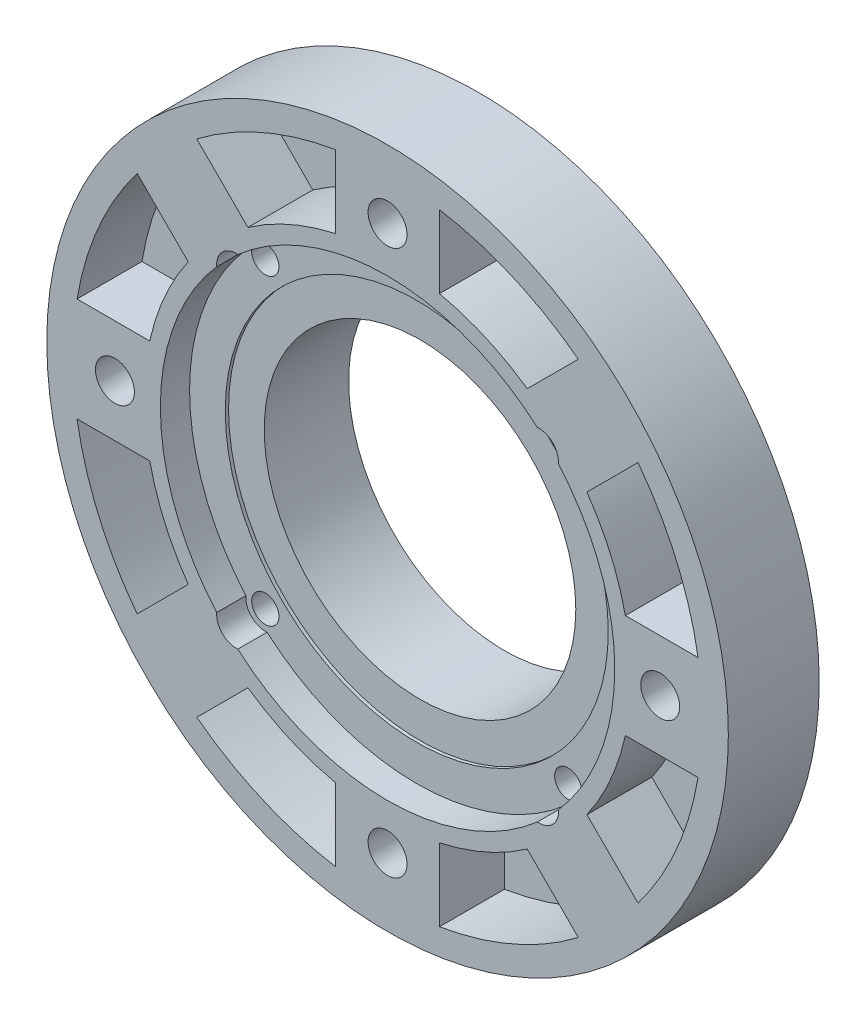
from build123d import *

# Parameters (mm, degrees)
ESQUISSE1_R             = 52.5
ESQUISSE1_R_2           = 24
BASE_EXTRUSION_DEPTH    = 18
ESQUISSE2_R             = 35
ENL_V_MAT_EXTRU_1_DEPTH = 4.5
ESQUISSE3_R             = 29.5
ENL_V_MAT_EXTRU_2_DEPTH = 0.5
ESQUISSE4_R             = 52.5
ESQUISSE4_R_2           = 26
ENL_V_MAT_EXTRU_3_DEPTH = 2
ESQUISSE5_R             = 3
ENL_V_MAT_EXTRU_4_DEPTH = 76.950641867
ESQUISSE6_R             = 52.5
ENL_V_MAT_EXTRU_5_DEPTH = 2
ESQUISSE7_R             = 5.5
ENL_V_MAT_EXTRU_6_DEPTH = 6
ENL_V_MAT_EXTRU_7_DEPTH = 10
ESQUISSE9_R             = 2.1
ENL_V_MAT_EXTRU_8_DEPTH = 76.950641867
ESQUISSE10_R            = 3
ENL_V_MAT_EXTRU_9_DEPTH = 4.5


with BuildPart() as part:
    # Esquisse1 → Base-Extrusion (new body)
    with BuildSketch(Plane.XY):
        with Locations(Location((0, 0, 0), (0, 0, 180))):
            Circle(ESQUISSE1_R)
        Circle(ESQUISSE1_R_2, mode=Mode.SUBTRACT)
    extrude(amount=BASE_EXTRUSION_DEPTH)

    # Esquisse2 → Enl_v. mat.-Extru.1 (cut)
    with BuildSketch(Plane.XY.offset(18)):
        Circle(ESQUISSE2_R)
    extrude(amount=-ENL_V_MAT_EXTRU_1_DEPTH, mode=Mode.SUBTRACT)

    # Esquisse3 → Enl_v. mat.-Extru.2 (cut)
    with BuildSketch(Plane.XY.offset(13.5)):
        Circle(ESQUISSE3_R)
    extrude(amount=-ENL_V_MAT_EXTRU_2_DEPTH, mode=Mode.SUBTRACT)

    # Esquisse4 → Enl_v. mat.-Extru.3 (cut)
    with BuildSketch(Plane(origin=(0, 0, 0), x_dir=(-1, 0, 0), z_dir=(0, 0, -1))):
        Circle(ESQUISSE4_R)
        Circle(ESQUISSE4_R_2, mode=Mode.SUBTRACT)
    extrude(amount=-ENL_V_MAT_EXTRU_3_DEPTH, mode=Mode.SUBTRACT)

    # Esquisse5 → Enl_v. mat.-Extru.4 (cut, through all)
    with BuildSketch(Plane(origin=(0, 0, 2), x_dir=(-1, 0, 0), z_dir=(0, 0, -1))):
        with Locations((42, 0)):
            Circle(ESQUISSE5_R)
        with Locations((0, -42)):
            Circle(ESQUISSE5_R)
        with Locations((-42, 0)):
            Circle(ESQUISSE5_R)
        with Locations((0, 42)):
            Circle(ESQUISSE5_R)
    extrude(amount=-ENL_V_MAT_EXTRU_4_DEPTH, mode=Mode.SUBTRACT)

    # Esquisse6 → Enl_v. mat.-Extru.5 (cut)
    with BuildSketch(Plane(origin=(0, 0, 2), x_dir=(-1, 0, 0), z_dir=(0, 0, -1))):
        Circle(ESQUISSE6_R)
        with BuildLine():
            ThreePointArc((38.468468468, 10.962524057), (28.284271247, 28.284271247), (10.962524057, 38.468468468))
            ThreePointArc((10.962524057, 38.468468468), (9.070885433, 38.386238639), (7.605251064, 37.1875))
            ThreePointArc((7.605251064, 37.1875), (0, 33), (-7.605251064, 37.1875))
            ThreePointArc((-7.605251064, 37.1875), (-9.070885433, 38.386238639), (-10.962524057, 38.468468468))
            ThreePointArc((-10.962524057, 38.468468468), (-28.284271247, 28.284271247), (-38.468468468, 10.962524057))
            ThreePointArc((-38.468468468, 10.962524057), (-38.386238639, 9.070885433), (-37.1875, 7.605251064))
            ThreePointArc((-37.1875, 7.605251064), (-33, 0), (-37.1875, -7.605251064))
            ThreePointArc((-37.1875, -7.605251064), (-38.386238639, -9.070885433), (-38.468468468, -10.962524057))
            ThreePointArc((-38.468468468, -10.962524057), (-28.284271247, -28.284271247), (-10.962524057, -38.468468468))
            ThreePointArc((-10.962524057, -38.468468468), (-9.070885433, -38.386238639), (-7.605251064, -37.1875))
            ThreePointArc((-7.605251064, -37.1875), (0, -33), (7.605251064, -37.1875))
            ThreePointArc((7.605251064, -37.1875), (9.070885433, -38.386238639), (10.962524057, -38.468468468))
            ThreePointArc((10.962524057, -38.468468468), (28.284271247, -28.284271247), (38.468468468, -10.962524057))
            ThreePointArc((38.468468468, -10.962524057), (38.386238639, -9.070885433), (37.1875, -7.605251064))
            ThreePointArc((37.1875, -7.605251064), (33, 0), (37.1875, 7.605251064))
            ThreePointArc((37.1875, 7.605251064), (38.386238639, 9.070885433), (38.468468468, 10.962524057))
        make_face(mode=Mode.SUBTRACT)
    extrude(amount=-ENL_V_MAT_EXTRU_5_DEPTH, mode=Mode.SUBTRACT)

    # Esquisse7 → Enl_v. mat.-Extru.6 (cut)
    with BuildSketch(Plane(origin=(0, 0, 4), x_dir=(-1, 0, 0), z_dir=(0, 0, -1))):
        with Locations((0, 42)):
            Circle(ESQUISSE7_R)
        with Locations((42, 0)):
            Circle(ESQUISSE7_R)
        with Locations((0, -42)):
            Circle(ESQUISSE7_R)
        with Locations((-42, 0)):
            Circle(ESQUISSE7_R)
    extrude(amount=-ENL_V_MAT_EXTRU_6_DEPTH, mode=Mode.SUBTRACT)

    # Esquisse8 → Enl_v. mat.-Extru.7 (cut)
    with BuildSketch(Plane.XY.offset(18)):
        with BuildLine():
            Line((-8, -36.636730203), (-8, -47.835656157))
            ThreePointArc((-8, -47.835656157), (-19.258661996, -44.512402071), (-29.389096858, -38.581485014))
            Line((-29.389096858, -38.581485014), (-21.518935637, -30.711323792))
            ThreePointArc((-21.518935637, -30.711323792), (-15.05388656, -34.345749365), (-8, -36.636730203))
        make_face()
        with BuildLine():
            Line((-8, 47.835656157), (-8, 36.636730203))
            ThreePointArc((-8, 36.636730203), (-15.05388656, 34.345749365), (-21.518935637, 30.711323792))
            Line((-21.518935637, 30.711323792), (-29.389096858, 38.581485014))
            ThreePointArc((-29.389096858, 38.581485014), (-19.258661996, 44.512402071), (-8, 47.835656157))
        make_face()
        with BuildLine():
            Line((8, 47.835656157), (8, 36.636730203))
            ThreePointArc((8, 36.636730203), (15.05388656, 34.345749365), (21.518935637, 30.711323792))
            Line((21.518935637, 30.711323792), (29.389096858, 38.581485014))
            ThreePointArc((29.389096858, 38.581485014), (19.258661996, 44.512402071), (8, 47.835656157))
        make_face()
        with BuildLine():
            Line((8, -36.636730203), (8, -47.835656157))
            ThreePointArc((8, -47.835656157), (19.258661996, -44.512402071), (29.389096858, -38.581485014))
            Line((29.389096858, -38.581485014), (21.518935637, -30.711323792))
            ThreePointArc((21.518935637, -30.711323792), (15.05388656, -34.345749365), (8, -36.636730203))
        make_face()
        with BuildLine():
            Line((-47.835656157, 8), (-36.636730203, 8))
            ThreePointArc((-36.636730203, 8), (-34.345749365, 15.05388656), (-30.711323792, 21.518935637))
            Line((-30.711323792, 21.518935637), (-38.581485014, 29.389096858))
            ThreePointArc((-38.581485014, 29.389096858), (-44.512402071, 19.258661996), (-47.835656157, 8))
        make_face()
        with BuildLine():
            Line((-47.835656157, -8), (-36.636730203, -8))
            ThreePointArc((-36.636730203, -8), (-34.345749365, -15.05388656), (-30.711323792, -21.518935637))
            Line((-30.711323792, -21.518935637), (-38.581485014, -29.389096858))
            ThreePointArc((-38.581485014, -29.389096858), (-44.512402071, -19.258661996), (-47.835656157, -8))
        make_face()
        with BuildLine():
            Line((36.636730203, -8), (47.835656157, -8))
            ThreePointArc((47.835656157, -8), (44.512402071, -19.258661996), (38.581485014, -29.389096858))
            Line((38.581485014, -29.389096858), (30.711323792, -21.518935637))
            ThreePointArc((30.711323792, -21.518935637), (34.345749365, -15.05388656), (36.636730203, -8))
        make_face()
        with BuildLine():
            Line((36.636730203, 8), (47.835656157, 8))
            ThreePointArc((47.835656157, 8), (44.512402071, 19.258661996), (38.581485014, 29.389096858))
            Line((38.581485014, 29.389096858), (30.711323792, 21.518935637))
            ThreePointArc((30.711323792, 21.518935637), (34.345749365, 15.05388656), (36.636730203, 8))
        make_face()
    extrude(amount=-ENL_V_MAT_EXTRU_7_DEPTH, mode=Mode.SUBTRACT)

    # Esquisse9 → Enl_v. mat.-Extru.8 (cut, through all)
    with BuildSketch(Plane(origin=(0, 0, 2), x_dir=(-1, 0, 0), z_dir=(0, 0, -1))):
        with Locations((23.334523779, 23.334523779)):
            Circle(ESQUISSE9_R)
        with Locations((23.334523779, -23.334523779)):
            Circle(ESQUISSE9_R)
        with Locations((-23.334523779, -23.334523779)):
            Circle(ESQUISSE9_R)
        with Locations((-23.334523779, 23.334523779)):
            Circle(ESQUISSE9_R)
    extrude(amount=-ENL_V_MAT_EXTRU_8_DEPTH, mode=Mode.SUBTRACT)

    # Esquisse10 → Enl_v. mat.-Extru.9 (cut)
    with BuildSketch(Plane.XY.offset(18)):
        with Locations((23.334523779, 23.334523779)):
            Circle(ESQUISSE10_R)
        with Locations((-23.334523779, 23.334523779)):
            Circle(ESQUISSE10_R)
        with Locations((-23.334523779, -23.334523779)):
            Circle(ESQUISSE10_R)
        with Locations((23.334523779, -23.334523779)):
            Circle(ESQUISSE10_R)
    extrude(amount=-ENL_V_MAT_EXTRU_9_DEPTH, mode=Mode.SUBTRACT)


solid = part.part
